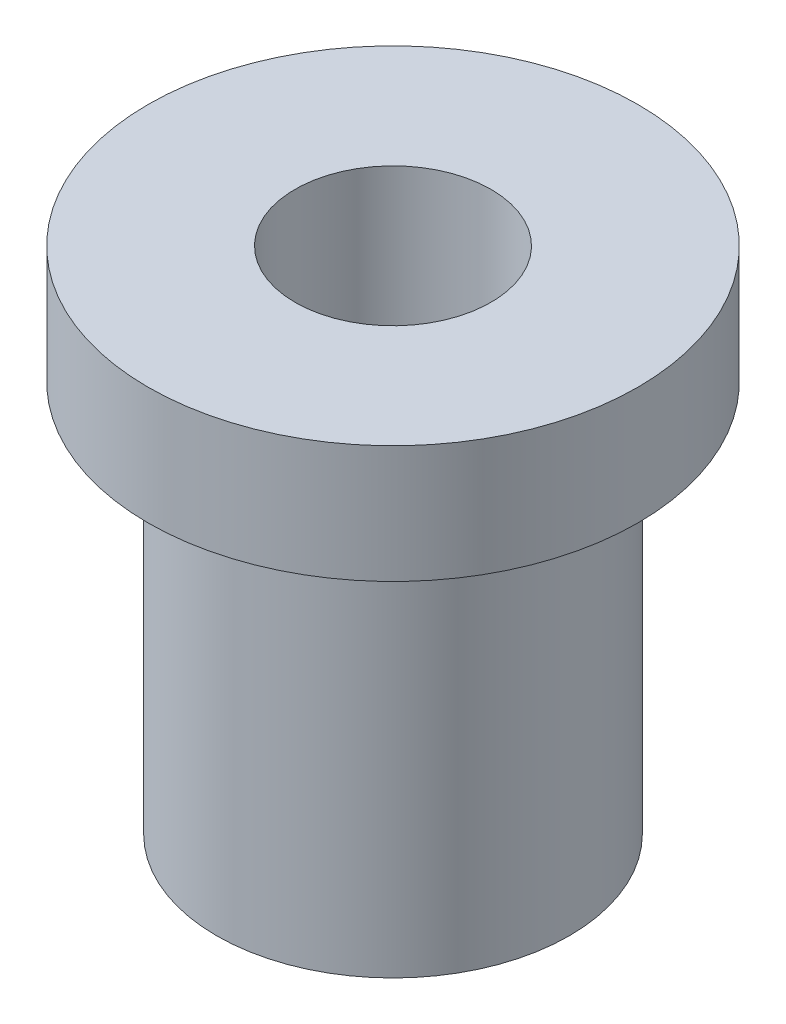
from build123d import *


with BuildPart() as part:
    # Szkic1 → Obr_t1 (revolve)
    with BuildSketch(Plane.XY, mode=Mode.PRIVATE) as obr_t1_sk:
        Polygon((5, 0), (5, 26), (12.5, 26), (12.5, 20), (9, 20), (9, 0), align=None)
    revolve(obr_t1_sk.sketch.rotate(Axis((0, 0, 0), (0, 1, 0)), 90), axis=Axis((0, 0, 0), (0, 1, 0)))


solid = part.part
